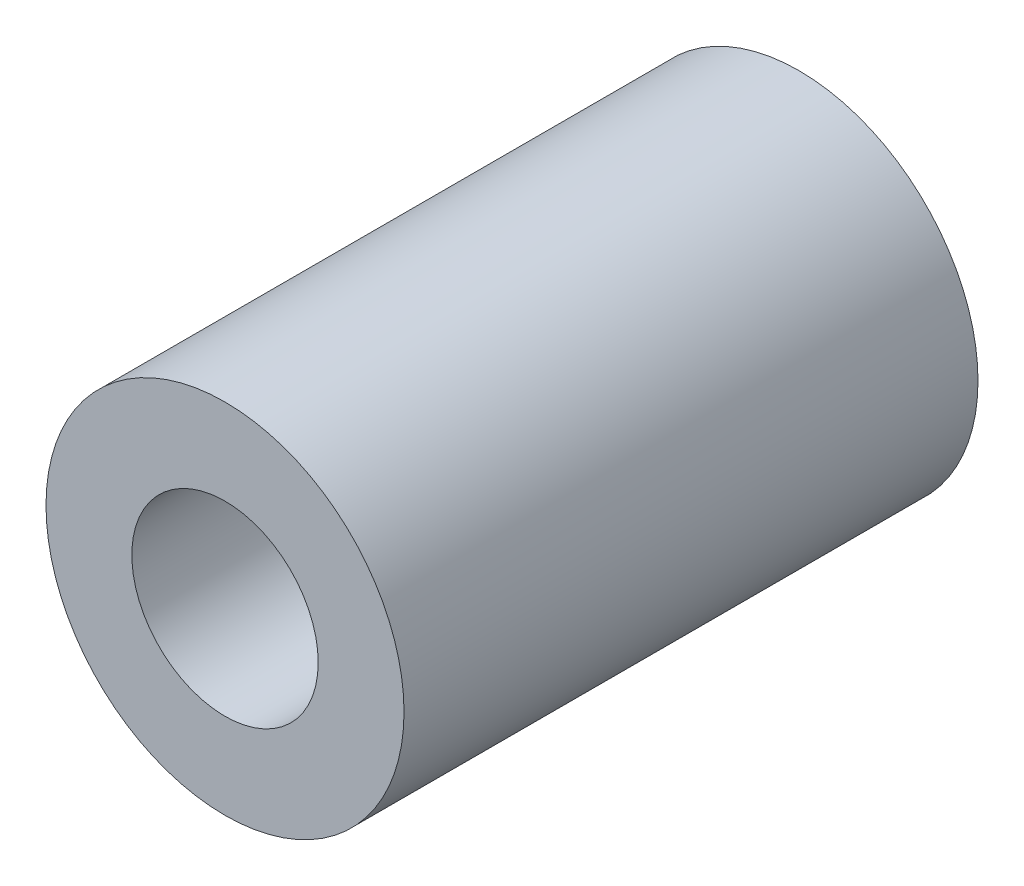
ISO-10303-21;
HEADER;
FILE_DESCRIPTION(('STEP AP214'),'2;1');
FILE_NAME('part.step','',(''),(''),'','','');
FILE_SCHEMA(('AUTOMOTIVE_DESIGN { 1 0 10303 214 1 1 1 1 }'));
ENDSEC;
DATA;
#1=APPLICATION_CONTEXT('core data for automotive mechanical design processes');
#2=APPLICATION_PROTOCOL_DEFINITION('international standard','automotive_design',2000,#1);
#3=PRODUCT_CONTEXT('',#1,'mechanical');
#4=PRODUCT('Part','Part','',(#3));
#5=PRODUCT_RELATED_PRODUCT_CATEGORY('part','',(#4));
#6=PRODUCT_DEFINITION_FORMATION('','',#4);
#7=PRODUCT_DEFINITION_CONTEXT('part definition',#1,'design');
#8=PRODUCT_DEFINITION('design','',#6,#7);
#9=PRODUCT_DEFINITION_SHAPE('','',#8);
#10=(LENGTH_UNIT() NAMED_UNIT(*) SI_UNIT(.MILLI.,.METRE.));
#11=(NAMED_UNIT(*) PLANE_ANGLE_UNIT() SI_UNIT($,.RADIAN.));
#12=(NAMED_UNIT(*) SI_UNIT($,.STERADIAN.) SOLID_ANGLE_UNIT());
#13=UNCERTAINTY_MEASURE_WITH_UNIT(LENGTH_MEASURE(1.E-05),#10,'distance_accuracy_value','');
#14=(GEOMETRIC_REPRESENTATION_CONTEXT(3) GLOBAL_UNCERTAINTY_ASSIGNED_CONTEXT((#13)) GLOBAL_UNIT_ASSIGNED_CONTEXT((#10,
#11,#12)) REPRESENTATION_CONTEXT('',''));
#15=CARTESIAN_POINT('',(0.,0.,0.));
#16=DIRECTION('',(0.,0.,1.));
#17=DIRECTION('',(1.,0.,0.));
#18=AXIS2_PLACEMENT_3D('',#15,#16,#17);
#19=CARTESIAN_POINT('',(0.,0.,6.4135));
#20=DIRECTION('',(0.,0.,-1.));
#21=DIRECTION('',(-1.,0.,0.));
#22=AXIS2_PLACEMENT_3D('',#19,#20,#21);
#23=CYLINDRICAL_SURFACE('',#22,4.0005);
#24=CARTESIAN_POINT('',(0.,0.,6.4135));
#25=DIRECTION('',(0.,0.,1.));
#26=DIRECTION('',(1.,0.,0.));
#27=AXIS2_PLACEMENT_3D('',#24,#25,#26);
#28=CIRCLE('',#27,4.0005);
#29=CARTESIAN_POINT('',(4.0005,0.,6.4135));
#30=VERTEX_POINT('',#29);
#31=EDGE_CURVE('E10',#30,#30,#28,.T.);
#32=ORIENTED_EDGE('',*,*,#31,.F.);
#33=EDGE_LOOP('',(#32));
#34=FACE_BOUND('',#33,.T.);
#35=CARTESIAN_POINT('',(0.,0.,-6.4135));
#36=DIRECTION('',(0.,0.,1.));
#37=DIRECTION('',(1.,0.,0.));
#38=AXIS2_PLACEMENT_3D('',#35,#36,#37);
#39=CIRCLE('',#38,4.0005);
#40=CARTESIAN_POINT('',(4.0005,0.,-6.4135));
#41=VERTEX_POINT('',#40);
#42=EDGE_CURVE('E34',#41,#41,#39,.T.);
#43=ORIENTED_EDGE('',*,*,#42,.T.);
#44=EDGE_LOOP('',(#43));
#45=FACE_BOUND('',#44,.T.);
#46=ADVANCED_FACE('F28',(#34,#45),#23,.T.);
#47=CARTESIAN_POINT('',(0.,0.,6.4135));
#48=DIRECTION('',(0.,0.,1.));
#49=DIRECTION('',(1.,0.,0.));
#50=AXIS2_PLACEMENT_3D('',#47,#48,#49);
#51=PLANE('',#50);
#52=CARTESIAN_POINT('',(0.,0.,6.4135));
#53=DIRECTION('',(0.,0.,1.));
#54=DIRECTION('',(1.,0.,0.));
#55=AXIS2_PLACEMENT_3D('',#52,#53,#54);
#56=CIRCLE('',#55,2.0828);
#57=CARTESIAN_POINT('',(2.0828,0.,6.4135));
#58=VERTEX_POINT('',#57);
#59=EDGE_CURVE('E42',#58,#58,#56,.T.);
#60=ORIENTED_EDGE('',*,*,#59,.F.);
#61=EDGE_LOOP('',(#60));
#62=FACE_BOUND('',#61,.T.);
#63=ORIENTED_EDGE('',*,*,#31,.T.);
#64=EDGE_LOOP('',(#63));
#65=FACE_BOUND('',#64,.T.);
#66=ADVANCED_FACE('F50',(#62,#65),#51,.T.);
#67=CARTESIAN_POINT('',(0.,0.,-6.4135));
#68=DIRECTION('',(0.,0.,1.));
#69=DIRECTION('',(1.,0.,0.));
#70=AXIS2_PLACEMENT_3D('',#67,#68,#69);
#71=PLANE('',#70);
#72=CARTESIAN_POINT('',(0.,0.,-6.4135));
#73=DIRECTION('',(0.,0.,1.));
#74=DIRECTION('',(1.,0.,0.));
#75=AXIS2_PLACEMENT_3D('',#72,#73,#74);
#76=CIRCLE('',#75,2.0828);
#77=CARTESIAN_POINT('',(2.0828,0.,-6.4135));
#78=VERTEX_POINT('',#77);
#79=EDGE_CURVE('E38',#78,#78,#76,.T.);
#80=ORIENTED_EDGE('',*,*,#79,.T.);
#81=EDGE_LOOP('',(#80));
#82=FACE_BOUND('',#81,.T.);
#83=ORIENTED_EDGE('',*,*,#42,.F.);
#84=EDGE_LOOP('',(#83));
#85=FACE_BOUND('',#84,.T.);
#86=ADVANCED_FACE('F52',(#82,#85),#71,.F.);
#87=CARTESIAN_POINT('',(0.,0.,-6.4135));
#88=DIRECTION('',(0.,0.,1.));
#89=DIRECTION('',(1.,0.,0.));
#90=AXIS2_PLACEMENT_3D('',#87,#88,#89);
#91=CYLINDRICAL_SURFACE('',#90,2.0828);
#92=ORIENTED_EDGE('',*,*,#79,.F.);
#93=EDGE_LOOP('',(#92));
#94=FACE_BOUND('',#93,.T.);
#95=ORIENTED_EDGE('',*,*,#59,.T.);
#96=EDGE_LOOP('',(#95));
#97=FACE_BOUND('',#96,.T.);
#98=ADVANCED_FACE('F48',(#94,#97),#91,.F.);
#99=CLOSED_SHELL('',(#46,#66,#86,#98));
#100=MANIFOLD_SOLID_BREP('B2',#99);
#101=ADVANCED_BREP_SHAPE_REPRESENTATION('',(#18,#100),#14);
#102=SHAPE_DEFINITION_REPRESENTATION(#9,#101);
ENDSEC;
END-ISO-10303-21;
